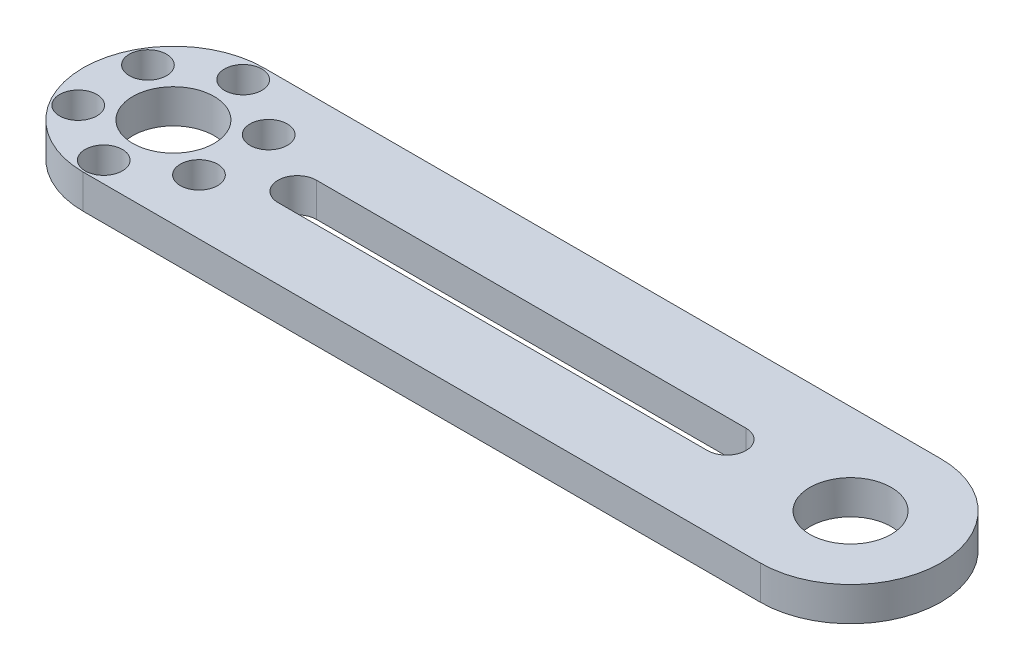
ISO-10303-21;
HEADER;
FILE_DESCRIPTION(('STEP AP214'),'2;1');
FILE_NAME('part.step','',(''),(''),'','','');
FILE_SCHEMA(('AUTOMOTIVE_DESIGN { 1 0 10303 214 1 1 1 1 }'));
ENDSEC;
DATA;
#1=APPLICATION_CONTEXT('core data for automotive mechanical design processes');
#2=APPLICATION_PROTOCOL_DEFINITION('international standard','automotive_design',2000,#1);
#3=PRODUCT_CONTEXT('',#1,'mechanical');
#4=PRODUCT('Part','Part','',(#3));
#5=PRODUCT_RELATED_PRODUCT_CATEGORY('part','',(#4));
#6=PRODUCT_DEFINITION_FORMATION('','',#4);
#7=PRODUCT_DEFINITION_CONTEXT('part definition',#1,'design');
#8=PRODUCT_DEFINITION('design','',#6,#7);
#9=PRODUCT_DEFINITION_SHAPE('','',#8);
#10=(LENGTH_UNIT() NAMED_UNIT(*) SI_UNIT(.MILLI.,.METRE.));
#11=(NAMED_UNIT(*) PLANE_ANGLE_UNIT() SI_UNIT($,.RADIAN.));
#12=(NAMED_UNIT(*) SI_UNIT($,.STERADIAN.) SOLID_ANGLE_UNIT());
#13=UNCERTAINTY_MEASURE_WITH_UNIT(LENGTH_MEASURE(1.E-05),#10,'distance_accuracy_value','');
#14=(GEOMETRIC_REPRESENTATION_CONTEXT(3) GLOBAL_UNCERTAINTY_ASSIGNED_CONTEXT((#13)) GLOBAL_UNIT_ASSIGNED_CONTEXT((#10,
#11,#12)) REPRESENTATION_CONTEXT('',''));
#15=CARTESIAN_POINT('',(0.,0.,0.));
#16=DIRECTION('',(0.,0.,1.));
#17=DIRECTION('',(1.,0.,0.));
#18=AXIS2_PLACEMENT_3D('',#15,#16,#17);
#19=CARTESIAN_POINT('',(51.,2.56,0.));
#20=DIRECTION('',(0.,1.,0.));
#21=DIRECTION('',(0.,0.,1.));
#22=AXIS2_PLACEMENT_3D('',#19,#20,#21);
#23=PLANE('',#22);
#24=CARTESIAN_POINT('',(-51.,2.56,-10.5));
#25=DIRECTION('',(0.,1.,0.));
#26=DIRECTION('',(0.,0.,1.));
#27=AXIS2_PLACEMENT_3D('',#24,#25,#26);
#28=CIRCLE('',#27,2.81);
#29=CARTESIAN_POINT('',(-51.,2.56,-7.68999999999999));
#30=VERTEX_POINT('',#29);
#31=EDGE_CURVE('E353',#30,#30,#28,.T.);
#32=ORIENTED_EDGE('',*,*,#31,.F.);
#33=EDGE_LOOP('',(#32));
#34=FACE_BOUND('',#33,.T.);
#35=CARTESIAN_POINT('',(-41.9067332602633,2.56,-5.2500000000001));
#36=DIRECTION('',(0.,1.,0.));
#37=DIRECTION('',(0.,0.,1.));
#38=AXIS2_PLACEMENT_3D('',#35,#36,#37);
#39=CIRCLE('',#38,2.81000000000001);
#40=CARTESIAN_POINT('',(-41.9067332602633,2.56,-2.44000000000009));
#41=VERTEX_POINT('',#40);
#42=EDGE_CURVE('E357',#41,#41,#39,.T.);
#43=ORIENTED_EDGE('',*,*,#42,.F.);
#44=EDGE_LOOP('',(#43));
#45=FACE_BOUND('',#44,.T.);
#46=CARTESIAN_POINT('',(-41.9067332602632,2.56,5.24999999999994));
#47=DIRECTION('',(0.,1.,0.));
#48=DIRECTION('',(0.,0.,1.));
#49=AXIS2_PLACEMENT_3D('',#46,#47,#48);
#50=CIRCLE('',#49,2.81000000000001);
#51=CARTESIAN_POINT('',(-41.9067332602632,2.56,8.05999999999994));
#52=VERTEX_POINT('',#51);
#53=EDGE_CURVE('E369',#52,#52,#50,.T.);
#54=ORIENTED_EDGE('',*,*,#53,.F.);
#55=EDGE_LOOP('',(#54));
#56=FACE_BOUND('',#55,.T.);
#57=CARTESIAN_POINT('',(-50.9999999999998,2.56,10.5));
#58=DIRECTION('',(0.,1.,0.));
#59=DIRECTION('',(0.,0.,1.));
#60=AXIS2_PLACEMENT_3D('',#57,#58,#59);
#61=CIRCLE('',#60,2.81);
#62=CARTESIAN_POINT('',(-50.9999999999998,2.56,13.31));
#63=VERTEX_POINT('',#62);
#64=EDGE_CURVE('E374',#63,#63,#61,.T.);
#65=ORIENTED_EDGE('',*,*,#64,.F.);
#66=EDGE_LOOP('',(#65));
#67=FACE_BOUND('',#66,.T.);
#68=CARTESIAN_POINT('',(-60.0932667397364,2.56,5.25000000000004));
#69=DIRECTION('',(0.,1.,0.));
#70=DIRECTION('',(0.,0.,1.));
#71=AXIS2_PLACEMENT_3D('',#68,#69,#70);
#72=CIRCLE('',#71,2.81);
#73=CARTESIAN_POINT('',(-60.0932667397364,2.56,8.06000000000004));
#74=VERTEX_POINT('',#73);
#75=EDGE_CURVE('E380',#74,#74,#72,.T.);
#76=ORIENTED_EDGE('',*,*,#75,.F.);
#77=EDGE_LOOP('',(#76));
#78=FACE_BOUND('',#77,.T.);
#79=CARTESIAN_POINT('',(-60.0932667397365,2.56,-5.24999999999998));
#80=DIRECTION('',(0.,1.,0.));
#81=DIRECTION('',(0.,0.,1.));
#82=AXIS2_PLACEMENT_3D('',#79,#80,#81);
#83=CIRCLE('',#82,2.81);
#84=CARTESIAN_POINT('',(-60.0932667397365,2.56,-2.43999999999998));
#85=VERTEX_POINT('',#84);
#86=EDGE_CURVE('E400',#85,#85,#83,.T.);
#87=ORIENTED_EDGE('',*,*,#86,.F.);
#88=EDGE_LOOP('',(#87));
#89=FACE_BOUND('',#88,.T.);
#90=CARTESIAN_POINT('',(51.,2.56,0.));
#91=DIRECTION('',(0.,1.,0.));
#92=DIRECTION('',(0.,0.,-1.));
#93=AXIS2_PLACEMENT_3D('',#90,#91,#92);
#94=CIRCLE('',#93,6.13);
#95=CARTESIAN_POINT('',(51.,2.56,-6.12999999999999));
#96=VERTEX_POINT('',#95);
#97=EDGE_CURVE('E365',#96,#96,#94,.T.);
#98=ORIENTED_EDGE('',*,*,#97,.F.);
#99=EDGE_LOOP('',(#98));
#100=FACE_BOUND('',#99,.T.);
#101=CARTESIAN_POINT('',(-51.,2.56,0.));
#102=DIRECTION('',(0.,1.,0.));
#103=DIRECTION('',(0.,0.,1.));
#104=AXIS2_PLACEMENT_3D('',#101,#102,#103);
#105=CIRCLE('',#104,6.13);
#106=CARTESIAN_POINT('',(-51.,2.56,6.13000000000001));
#107=VERTEX_POINT('',#106);
#108=EDGE_CURVE('E359',#107,#107,#105,.T.);
#109=ORIENTED_EDGE('',*,*,#108,.F.);
#110=EDGE_LOOP('',(#109));
#111=FACE_BOUND('',#110,.T.);
#112=CARTESIAN_POINT('',(51.,2.56,0.));
#113=DIRECTION('',(0.,1.,0.));
#114=DIRECTION('',(0.,0.,1.));
#115=AXIS2_PLACEMENT_3D('',#112,#113,#114);
#116=CIRCLE('',#115,13.6);
#117=CARTESIAN_POINT('',(51.,2.56,13.6));
#118=VERTEX_POINT('',#117);
#119=CARTESIAN_POINT('',(51.,2.56,-13.6));
#120=VERTEX_POINT('',#119);
#121=EDGE_CURVE('E165',#118,#120,#116,.T.);
#122=ORIENTED_EDGE('',*,*,#121,.T.);
#123=DIRECTION('',(-1.,0.,0.));
#124=VECTOR('',#123,1.);
#125=CARTESIAN_POINT('',(51.,2.56,-13.6));
#126=LINE('',#125,#124);
#127=CARTESIAN_POINT('',(-51.,2.56,-13.6));
#128=VERTEX_POINT('',#127);
#129=EDGE_CURVE('E168',#120,#128,#126,.T.);
#130=ORIENTED_EDGE('',*,*,#129,.T.);
#131=CARTESIAN_POINT('',(-51.,2.56,0.));
#132=DIRECTION('',(0.,1.,0.));
#133=DIRECTION('',(0.,0.,1.));
#134=AXIS2_PLACEMENT_3D('',#131,#132,#133);
#135=CIRCLE('',#134,13.6);
#136=CARTESIAN_POINT('',(-51.,2.56,13.6));
#137=VERTEX_POINT('',#136);
#138=EDGE_CURVE('E171',#128,#137,#135,.T.);
#139=ORIENTED_EDGE('',*,*,#138,.T.);
#140=DIRECTION('',(-1.,0.,0.));
#141=VECTOR('',#140,1.);
#142=CARTESIAN_POINT('',(51.,2.56,13.6));
#143=LINE('',#142,#141);
#144=EDGE_CURVE('E173',#118,#137,#143,.T.);
#145=ORIENTED_EDGE('',*,*,#144,.F.);
#146=EDGE_LOOP('',(#122,#130,#139,#145));
#147=FACE_BOUND('',#146,.T.);
#148=DIRECTION('',(-1.,0.,0.));
#149=VECTOR('',#148,1.);
#150=CARTESIAN_POINT('',(32.35,2.56,-2.91000000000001));
#151=LINE('',#150,#149);
#152=CARTESIAN_POINT('',(32.35,2.56,-2.91000000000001));
#153=VERTEX_POINT('',#152);
#154=CARTESIAN_POINT('',(-32.35,2.56,-2.90999999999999));
#155=VERTEX_POINT('',#154);
#156=EDGE_CURVE('E136',#153,#155,#151,.T.);
#157=ORIENTED_EDGE('',*,*,#156,.F.);
#158=CARTESIAN_POINT('',(32.35,2.56,0.));
#159=DIRECTION('',(0.,1.,0.));
#160=DIRECTION('',(0.,0.,1.));
#161=AXIS2_PLACEMENT_3D('',#158,#159,#160);
#162=CIRCLE('',#161,2.91);
#163=CARTESIAN_POINT('',(32.35,2.56,2.90999999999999));
#164=VERTEX_POINT('',#163);
#165=EDGE_CURVE('E128',#164,#153,#162,.T.);
#166=ORIENTED_EDGE('',*,*,#165,.F.);
#167=DIRECTION('',(-1.,0.,0.));
#168=VECTOR('',#167,1.);
#169=CARTESIAN_POINT('',(32.35,2.56,2.90999999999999));
#170=LINE('',#169,#168);
#171=CARTESIAN_POINT('',(-32.35,2.56,2.91000000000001));
#172=VERTEX_POINT('',#171);
#173=EDGE_CURVE('E150',#164,#172,#170,.T.);
#174=ORIENTED_EDGE('',*,*,#173,.T.);
#175=CARTESIAN_POINT('',(-32.35,2.56,0.));
#176=DIRECTION('',(0.,1.,0.));
#177=DIRECTION('',(0.,0.,1.));
#178=AXIS2_PLACEMENT_3D('',#175,#176,#177);
#179=CIRCLE('',#178,2.91);
#180=EDGE_CURVE('E148',#155,#172,#179,.T.);
#181=ORIENTED_EDGE('',*,*,#180,.F.);
#182=EDGE_LOOP('',(#157,#166,#174,#181));
#183=FACE_BOUND('',#182,.T.);
#184=ADVANCED_FACE('F63',(#34,#45,#56,#67,#78,#89,#100,#111,#147,#183),#23,.T.);
#185=CARTESIAN_POINT('',(51.,-2.56,0.));
#186=DIRECTION('',(0.,1.,0.));
#187=DIRECTION('',(0.,0.,1.));
#188=AXIS2_PLACEMENT_3D('',#185,#186,#187);
#189=PLANE('',#188);
#190=CARTESIAN_POINT('',(-51.,-2.56,-10.5));
#191=DIRECTION('',(0.,1.,0.));
#192=DIRECTION('',(0.,0.,1.));
#193=AXIS2_PLACEMENT_3D('',#190,#191,#192);
#194=CIRCLE('',#193,2.81);
#195=CARTESIAN_POINT('',(-51.,-2.56,-7.68999999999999));
#196=VERTEX_POINT('',#195);
#197=EDGE_CURVE('E356',#196,#196,#194,.F.);
#198=ORIENTED_EDGE('',*,*,#197,.F.);
#199=EDGE_LOOP('',(#198));
#200=FACE_BOUND('',#199,.T.);
#201=CARTESIAN_POINT('',(-41.9067332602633,-2.56,-5.2500000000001));
#202=DIRECTION('',(0.,1.,0.));
#203=DIRECTION('',(0.,0.,1.));
#204=AXIS2_PLACEMENT_3D('',#201,#202,#203);
#205=CIRCLE('',#204,2.81000000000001);
#206=CARTESIAN_POINT('',(-41.9067332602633,-2.56,-2.44000000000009));
#207=VERTEX_POINT('',#206);
#208=EDGE_CURVE('E362',#207,#207,#205,.F.);
#209=ORIENTED_EDGE('',*,*,#208,.F.);
#210=EDGE_LOOP('',(#209));
#211=FACE_BOUND('',#210,.T.);
#212=CARTESIAN_POINT('',(-41.9067332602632,-2.56,5.24999999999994));
#213=DIRECTION('',(0.,1.,0.));
#214=DIRECTION('',(0.,0.,1.));
#215=AXIS2_PLACEMENT_3D('',#212,#213,#214);
#216=CIRCLE('',#215,2.81000000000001);
#217=CARTESIAN_POINT('',(-41.9067332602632,-2.56,8.05999999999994));
#218=VERTEX_POINT('',#217);
#219=EDGE_CURVE('E371',#218,#218,#216,.F.);
#220=ORIENTED_EDGE('',*,*,#219,.F.);
#221=EDGE_LOOP('',(#220));
#222=FACE_BOUND('',#221,.T.);
#223=CARTESIAN_POINT('',(-50.9999999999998,-2.56,10.5));
#224=DIRECTION('',(0.,1.,0.));
#225=DIRECTION('',(0.,0.,1.));
#226=AXIS2_PLACEMENT_3D('',#223,#224,#225);
#227=CIRCLE('',#226,2.81);
#228=CARTESIAN_POINT('',(-50.9999999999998,-2.56,13.31));
#229=VERTEX_POINT('',#228);
#230=EDGE_CURVE('E377',#229,#229,#227,.F.);
#231=ORIENTED_EDGE('',*,*,#230,.F.);
#232=EDGE_LOOP('',(#231));
#233=FACE_BOUND('',#232,.T.);
#234=CARTESIAN_POINT('',(-60.0932667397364,-2.56,5.25000000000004));
#235=DIRECTION('',(0.,1.,0.));
#236=DIRECTION('',(0.,0.,1.));
#237=AXIS2_PLACEMENT_3D('',#234,#235,#236);
#238=CIRCLE('',#237,2.81);
#239=CARTESIAN_POINT('',(-60.0932667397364,-2.56,8.06000000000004));
#240=VERTEX_POINT('',#239);
#241=EDGE_CURVE('E411',#240,#240,#238,.F.);
#242=ORIENTED_EDGE('',*,*,#241,.F.);
#243=EDGE_LOOP('',(#242));
#244=FACE_BOUND('',#243,.T.);
#245=CARTESIAN_POINT('',(-60.0932667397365,-2.56,-5.24999999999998));
#246=DIRECTION('',(0.,1.,0.));
#247=DIRECTION('',(0.,0.,1.));
#248=AXIS2_PLACEMENT_3D('',#245,#246,#247);
#249=CIRCLE('',#248,2.81);
#250=CARTESIAN_POINT('',(-60.0932667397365,-2.56,-2.43999999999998));
#251=VERTEX_POINT('',#250);
#252=EDGE_CURVE('E403',#251,#251,#249,.F.);
#253=ORIENTED_EDGE('',*,*,#252,.F.);
#254=EDGE_LOOP('',(#253));
#255=FACE_BOUND('',#254,.T.);
#256=CARTESIAN_POINT('',(51.,-2.56,0.));
#257=DIRECTION('',(0.,1.,0.));
#258=DIRECTION('',(0.,0.,1.));
#259=AXIS2_PLACEMENT_3D('',#256,#257,#258);
#260=CIRCLE('',#259,6.13);
#261=CARTESIAN_POINT('',(51.,-2.56,6.13000000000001));
#262=VERTEX_POINT('',#261);
#263=EDGE_CURVE('E404',#262,#262,#260,.F.);
#264=ORIENTED_EDGE('',*,*,#263,.F.);
#265=EDGE_LOOP('',(#264));
#266=FACE_BOUND('',#265,.T.);
#267=CARTESIAN_POINT('',(-51.,-2.56,0.));
#268=DIRECTION('',(0.,1.,0.));
#269=DIRECTION('',(0.,0.,1.));
#270=AXIS2_PLACEMENT_3D('',#267,#268,#269);
#271=CIRCLE('',#270,6.13);
#272=CARTESIAN_POINT('',(-51.,-2.56,6.13000000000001));
#273=VERTEX_POINT('',#272);
#274=EDGE_CURVE('E156',#273,#273,#271,.F.);
#275=ORIENTED_EDGE('',*,*,#274,.F.);
#276=EDGE_LOOP('',(#275));
#277=FACE_BOUND('',#276,.T.);
#278=CARTESIAN_POINT('',(51.,-2.56,0.));
#279=DIRECTION('',(0.,1.,0.));
#280=DIRECTION('',(0.,0.,1.));
#281=AXIS2_PLACEMENT_3D('',#278,#279,#280);
#282=CIRCLE('',#281,13.6);
#283=CARTESIAN_POINT('',(51.,-2.56,13.6));
#284=VERTEX_POINT('',#283);
#285=CARTESIAN_POINT('',(51.,-2.56,-13.6));
#286=VERTEX_POINT('',#285);
#287=EDGE_CURVE('E144',#284,#286,#282,.T.);
#288=ORIENTED_EDGE('',*,*,#287,.F.);
#289=DIRECTION('',(-1.,0.,0.));
#290=VECTOR('',#289,1.);
#291=CARTESIAN_POINT('',(51.,-2.56,13.6));
#292=LINE('',#291,#290);
#293=CARTESIAN_POINT('',(-51.,-2.56,13.6));
#294=VERTEX_POINT('',#293);
#295=EDGE_CURVE('E169',#284,#294,#292,.T.);
#296=ORIENTED_EDGE('',*,*,#295,.T.);
#297=CARTESIAN_POINT('',(-51.,-2.56,0.));
#298=DIRECTION('',(0.,1.,0.));
#299=DIRECTION('',(0.,0.,1.));
#300=AXIS2_PLACEMENT_3D('',#297,#298,#299);
#301=CIRCLE('',#300,13.6);
#302=CARTESIAN_POINT('',(-51.,-2.56,-13.6));
#303=VERTEX_POINT('',#302);
#304=EDGE_CURVE('E181',#303,#294,#301,.T.);
#305=ORIENTED_EDGE('',*,*,#304,.F.);
#306=DIRECTION('',(-1.,0.,0.));
#307=VECTOR('',#306,1.);
#308=CARTESIAN_POINT('',(51.,-2.56,-13.6));
#309=LINE('',#308,#307);
#310=EDGE_CURVE('E179',#286,#303,#309,.T.);
#311=ORIENTED_EDGE('',*,*,#310,.F.);
#312=EDGE_LOOP('',(#288,#296,#305,#311));
#313=FACE_BOUND('',#312,.T.);
#314=CARTESIAN_POINT('',(32.35,-2.56,0.));
#315=DIRECTION('',(0.,1.,0.));
#316=DIRECTION('',(0.,0.,1.));
#317=AXIS2_PLACEMENT_3D('',#314,#315,#316);
#318=CIRCLE('',#317,2.91);
#319=CARTESIAN_POINT('',(32.35,-2.56,2.90999999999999));
#320=VERTEX_POINT('',#319);
#321=CARTESIAN_POINT('',(32.35,-2.56,-2.91000000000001));
#322=VERTEX_POINT('',#321);
#323=EDGE_CURVE('E86',#320,#322,#318,.T.);
#324=ORIENTED_EDGE('',*,*,#323,.T.);
#325=DIRECTION('',(-1.,0.,0.));
#326=VECTOR('',#325,1.);
#327=CARTESIAN_POINT('',(32.35,-2.56,-2.91000000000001));
#328=LINE('',#327,#326);
#329=CARTESIAN_POINT('',(-32.35,-2.56,-2.90999999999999));
#330=VERTEX_POINT('',#329);
#331=EDGE_CURVE('E143',#322,#330,#328,.T.);
#332=ORIENTED_EDGE('',*,*,#331,.T.);
#333=CARTESIAN_POINT('',(-32.35,-2.56,0.));
#334=DIRECTION('',(0.,1.,0.));
#335=DIRECTION('',(0.,0.,1.));
#336=AXIS2_PLACEMENT_3D('',#333,#334,#335);
#337=CIRCLE('',#336,2.91);
#338=CARTESIAN_POINT('',(-32.35,-2.56,2.91000000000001));
#339=VERTEX_POINT('',#338);
#340=EDGE_CURVE('E158',#330,#339,#337,.T.);
#341=ORIENTED_EDGE('',*,*,#340,.T.);
#342=DIRECTION('',(-1.,0.,0.));
#343=VECTOR('',#342,1.);
#344=CARTESIAN_POINT('',(32.35,-2.56,2.90999999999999));
#345=LINE('',#344,#343);
#346=EDGE_CURVE('E137',#320,#339,#345,.T.);
#347=ORIENTED_EDGE('',*,*,#346,.F.);
#348=EDGE_LOOP('',(#324,#332,#341,#347));
#349=FACE_BOUND('',#348,.T.);
#350=ADVANCED_FACE('F198',(#200,#211,#222,#233,#244,#255,#266,#277,#313,#349),#189,.F.);
#351=CARTESIAN_POINT('',(51.,2.56,0.));
#352=DIRECTION('',(0.,-1.,0.));
#353=DIRECTION('',(0.,0.,-1.));
#354=AXIS2_PLACEMENT_3D('',#351,#352,#353);
#355=CYLINDRICAL_SURFACE('',#354,13.6);
#356=ORIENTED_EDGE('',*,*,#287,.T.);
#357=DIRECTION('',(0.,-1.,0.));
#358=VECTOR('',#357,1.);
#359=CARTESIAN_POINT('',(51.,2.56,-13.6));
#360=LINE('',#359,#358);
#361=EDGE_CURVE('E12',#120,#286,#360,.T.);
#362=ORIENTED_EDGE('',*,*,#361,.F.);
#363=ORIENTED_EDGE('',*,*,#121,.F.);
#364=DIRECTION('',(0.,-1.,0.));
#365=VECTOR('',#364,1.);
#366=CARTESIAN_POINT('',(51.,2.56,13.6));
#367=LINE('',#366,#365);
#368=EDGE_CURVE('E176',#118,#284,#367,.T.);
#369=ORIENTED_EDGE('',*,*,#368,.T.);
#370=EDGE_LOOP('',(#356,#362,#363,#369));
#371=FACE_BOUND('',#370,.T.);
#372=ADVANCED_FACE('F65',(#371),#355,.T.);
#373=CARTESIAN_POINT('',(51.,2.56,-13.6));
#374=DIRECTION('',(0.,0.,1.));
#375=DIRECTION('',(1.,0.,0.));
#376=AXIS2_PLACEMENT_3D('',#373,#374,#375);
#377=PLANE('',#376);
#378=ORIENTED_EDGE('',*,*,#310,.T.);
#379=DIRECTION('',(0.,-1.,0.));
#380=VECTOR('',#379,1.);
#381=CARTESIAN_POINT('',(-51.,2.56,-13.6));
#382=LINE('',#381,#380);
#383=EDGE_CURVE('E71',#128,#303,#382,.T.);
#384=ORIENTED_EDGE('',*,*,#383,.F.);
#385=ORIENTED_EDGE('',*,*,#129,.F.);
#386=ORIENTED_EDGE('',*,*,#361,.T.);
#387=EDGE_LOOP('',(#378,#384,#385,#386));
#388=FACE_BOUND('',#387,.T.);
#389=ADVANCED_FACE('F207',(#388),#377,.F.);
#390=CARTESIAN_POINT('',(-51.,2.56,0.));
#391=DIRECTION('',(0.,-1.,0.));
#392=DIRECTION('',(0.,0.,-1.));
#393=AXIS2_PLACEMENT_3D('',#390,#391,#392);
#394=CYLINDRICAL_SURFACE('',#393,13.6);
#395=ORIENTED_EDGE('',*,*,#304,.T.);
#396=DIRECTION('',(0.,-1.,0.));
#397=VECTOR('',#396,1.);
#398=CARTESIAN_POINT('',(-51.,2.56,13.6));
#399=LINE('',#398,#397);
#400=EDGE_CURVE('E187',#137,#294,#399,.T.);
#401=ORIENTED_EDGE('',*,*,#400,.F.);
#402=ORIENTED_EDGE('',*,*,#138,.F.);
#403=ORIENTED_EDGE('',*,*,#383,.T.);
#404=EDGE_LOOP('',(#395,#401,#402,#403));
#405=FACE_BOUND('',#404,.T.);
#406=ADVANCED_FACE('F193',(#405),#394,.T.);
#407=CARTESIAN_POINT('',(51.,2.56,13.6));
#408=DIRECTION('',(0.,0.,1.));
#409=DIRECTION('',(1.,0.,0.));
#410=AXIS2_PLACEMENT_3D('',#407,#408,#409);
#411=PLANE('',#410);
#412=ORIENTED_EDGE('',*,*,#295,.F.);
#413=ORIENTED_EDGE('',*,*,#368,.F.);
#414=ORIENTED_EDGE('',*,*,#144,.T.);
#415=ORIENTED_EDGE('',*,*,#400,.T.);
#416=EDGE_LOOP('',(#412,#413,#414,#415));
#417=FACE_BOUND('',#416,.T.);
#418=ADVANCED_FACE('F202',(#417),#411,.T.);
#419=CARTESIAN_POINT('',(32.35,2.56,0.));
#420=DIRECTION('',(0.,-1.,0.));
#421=DIRECTION('',(0.,0.,-1.));
#422=AXIS2_PLACEMENT_3D('',#419,#420,#421);
#423=CYLINDRICAL_SURFACE('',#422,2.91);
#424=ORIENTED_EDGE('',*,*,#323,.F.);
#425=DIRECTION('',(0.,-1.,0.));
#426=VECTOR('',#425,1.);
#427=CARTESIAN_POINT('',(32.35,2.56,2.90999999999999));
#428=LINE('',#427,#426);
#429=EDGE_CURVE('E132',#164,#320,#428,.T.);
#430=ORIENTED_EDGE('',*,*,#429,.F.);
#431=ORIENTED_EDGE('',*,*,#165,.T.);
#432=DIRECTION('',(0.,-1.,0.));
#433=VECTOR('',#432,1.);
#434=CARTESIAN_POINT('',(32.35,2.56,-2.91000000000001));
#435=LINE('',#434,#433);
#436=EDGE_CURVE('E131',#153,#322,#435,.T.);
#437=ORIENTED_EDGE('',*,*,#436,.T.);
#438=EDGE_LOOP('',(#424,#430,#431,#437));
#439=FACE_BOUND('',#438,.T.);
#440=ADVANCED_FACE('F130',(#439),#423,.F.);
#441=CARTESIAN_POINT('',(32.35,2.56,-2.91000000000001));
#442=DIRECTION('',(0.,0.,1.));
#443=DIRECTION('',(1.,0.,0.));
#444=AXIS2_PLACEMENT_3D('',#441,#442,#443);
#445=PLANE('',#444);
#446=ORIENTED_EDGE('',*,*,#331,.F.);
#447=ORIENTED_EDGE('',*,*,#436,.F.);
#448=ORIENTED_EDGE('',*,*,#156,.T.);
#449=DIRECTION('',(0.,-1.,0.));
#450=VECTOR('',#449,1.);
#451=CARTESIAN_POINT('',(-32.35,2.56,-2.90999999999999));
#452=LINE('',#451,#450);
#453=EDGE_CURVE('E145',#155,#330,#452,.T.);
#454=ORIENTED_EDGE('',*,*,#453,.T.);
#455=EDGE_LOOP('',(#446,#447,#448,#454));
#456=FACE_BOUND('',#455,.T.);
#457=ADVANCED_FACE('F140',(#456),#445,.T.);
#458=CARTESIAN_POINT('',(-32.35,2.56,0.));
#459=DIRECTION('',(0.,-1.,0.));
#460=DIRECTION('',(0.,0.,-1.));
#461=AXIS2_PLACEMENT_3D('',#458,#459,#460);
#462=CYLINDRICAL_SURFACE('',#461,2.91);
#463=ORIENTED_EDGE('',*,*,#340,.F.);
#464=ORIENTED_EDGE('',*,*,#453,.F.);
#465=ORIENTED_EDGE('',*,*,#180,.T.);
#466=DIRECTION('',(0.,-1.,0.));
#467=VECTOR('',#466,1.);
#468=CARTESIAN_POINT('',(-32.35,2.56,2.91000000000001));
#469=LINE('',#468,#467);
#470=EDGE_CURVE('E78',#172,#339,#469,.T.);
#471=ORIENTED_EDGE('',*,*,#470,.T.);
#472=EDGE_LOOP('',(#463,#464,#465,#471));
#473=FACE_BOUND('',#472,.T.);
#474=ADVANCED_FACE('F252',(#473),#462,.F.);
#475=CARTESIAN_POINT('',(32.35,2.56,2.90999999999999));
#476=DIRECTION('',(0.,0.,1.));
#477=DIRECTION('',(1.,0.,0.));
#478=AXIS2_PLACEMENT_3D('',#475,#476,#477);
#479=PLANE('',#478);
#480=ORIENTED_EDGE('',*,*,#346,.T.);
#481=ORIENTED_EDGE('',*,*,#470,.F.);
#482=ORIENTED_EDGE('',*,*,#173,.F.);
#483=ORIENTED_EDGE('',*,*,#429,.T.);
#484=EDGE_LOOP('',(#480,#481,#482,#483));
#485=FACE_BOUND('',#484,.T.);
#486=ADVANCED_FACE('F258',(#485),#479,.F.);
#487=CARTESIAN_POINT('',(-51.,-2.561,0.));
#488=DIRECTION('',(0.,1.,0.));
#489=DIRECTION('',(0.,0.,1.));
#490=AXIS2_PLACEMENT_3D('',#487,#488,#489);
#491=CYLINDRICAL_SURFACE('',#490,6.13);
#492=ORIENTED_EDGE('',*,*,#108,.T.);
#493=EDGE_LOOP('',(#492));
#494=FACE_BOUND('',#493,.T.);
#495=ORIENTED_EDGE('',*,*,#274,.T.);
#496=EDGE_LOOP('',(#495));
#497=FACE_BOUND('',#496,.T.);
#498=ADVANCED_FACE('F266',(#494,#497),#491,.F.);
#499=CARTESIAN_POINT('',(51.,-2.561,0.));
#500=DIRECTION('',(0.,1.,0.));
#501=DIRECTION('',(0.,0.,1.));
#502=AXIS2_PLACEMENT_3D('',#499,#500,#501);
#503=CYLINDRICAL_SURFACE('',#502,6.13);
#504=ORIENTED_EDGE('',*,*,#97,.T.);
#505=EDGE_LOOP('',(#504));
#506=FACE_BOUND('',#505,.T.);
#507=ORIENTED_EDGE('',*,*,#263,.T.);
#508=EDGE_LOOP('',(#507));
#509=FACE_BOUND('',#508,.T.);
#510=ADVANCED_FACE('F278',(#506,#509),#503,.F.);
#511=CARTESIAN_POINT('',(-60.0932667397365,-2.561,-5.24999999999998));
#512=DIRECTION('',(0.,1.,0.));
#513=DIRECTION('',(0.,0.,1.));
#514=AXIS2_PLACEMENT_3D('',#511,#512,#513);
#515=CYLINDRICAL_SURFACE('',#514,2.81);
#516=ORIENTED_EDGE('',*,*,#86,.T.);
#517=EDGE_LOOP('',(#516));
#518=FACE_BOUND('',#517,.T.);
#519=ORIENTED_EDGE('',*,*,#252,.T.);
#520=EDGE_LOOP('',(#519));
#521=FACE_BOUND('',#520,.T.);
#522=ADVANCED_FACE('F288',(#518,#521),#515,.F.);
#523=CARTESIAN_POINT('',(-60.0932667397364,-2.561,5.25000000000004));
#524=DIRECTION('',(0.,1.,0.));
#525=DIRECTION('',(0.,0.,1.));
#526=AXIS2_PLACEMENT_3D('',#523,#524,#525);
#527=CYLINDRICAL_SURFACE('',#526,2.81);
#528=ORIENTED_EDGE('',*,*,#75,.T.);
#529=EDGE_LOOP('',(#528));
#530=FACE_BOUND('',#529,.T.);
#531=ORIENTED_EDGE('',*,*,#241,.T.);
#532=EDGE_LOOP('',(#531));
#533=FACE_BOUND('',#532,.T.);
#534=ADVANCED_FACE('F298',(#530,#533),#527,.F.);
#535=CARTESIAN_POINT('',(-50.9999999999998,-2.561,10.5));
#536=DIRECTION('',(0.,1.,0.));
#537=DIRECTION('',(0.,0.,1.));
#538=AXIS2_PLACEMENT_3D('',#535,#536,#537);
#539=CYLINDRICAL_SURFACE('',#538,2.81);
#540=ORIENTED_EDGE('',*,*,#64,.T.);
#541=EDGE_LOOP('',(#540));
#542=FACE_BOUND('',#541,.T.);
#543=ORIENTED_EDGE('',*,*,#230,.T.);
#544=EDGE_LOOP('',(#543));
#545=FACE_BOUND('',#544,.T.);
#546=ADVANCED_FACE('F308',(#542,#545),#539,.F.);
#547=CARTESIAN_POINT('',(-41.9067332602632,-2.561,5.24999999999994));
#548=DIRECTION('',(0.,1.,0.));
#549=DIRECTION('',(0.,0.,1.));
#550=AXIS2_PLACEMENT_3D('',#547,#548,#549);
#551=CYLINDRICAL_SURFACE('',#550,2.81000000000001);
#552=ORIENTED_EDGE('',*,*,#53,.T.);
#553=EDGE_LOOP('',(#552));
#554=FACE_BOUND('',#553,.T.);
#555=ORIENTED_EDGE('',*,*,#219,.T.);
#556=EDGE_LOOP('',(#555));
#557=FACE_BOUND('',#556,.T.);
#558=ADVANCED_FACE('F318',(#554,#557),#551,.F.);
#559=CARTESIAN_POINT('',(-41.9067332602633,-2.561,-5.2500000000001));
#560=DIRECTION('',(0.,1.,0.));
#561=DIRECTION('',(0.,0.,1.));
#562=AXIS2_PLACEMENT_3D('',#559,#560,#561);
#563=CYLINDRICAL_SURFACE('',#562,2.81000000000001);
#564=ORIENTED_EDGE('',*,*,#42,.T.);
#565=EDGE_LOOP('',(#564));
#566=FACE_BOUND('',#565,.T.);
#567=ORIENTED_EDGE('',*,*,#208,.T.);
#568=EDGE_LOOP('',(#567));
#569=FACE_BOUND('',#568,.T.);
#570=ADVANCED_FACE('F328',(#566,#569),#563,.F.);
#571=CARTESIAN_POINT('',(-51.,-2.561,-10.5));
#572=DIRECTION('',(0.,1.,0.));
#573=DIRECTION('',(0.,0.,1.));
#574=AXIS2_PLACEMENT_3D('',#571,#572,#573);
#575=CYLINDRICAL_SURFACE('',#574,2.81);
#576=ORIENTED_EDGE('',*,*,#31,.T.);
#577=EDGE_LOOP('',(#576));
#578=FACE_BOUND('',#577,.T.);
#579=ORIENTED_EDGE('',*,*,#197,.T.);
#580=EDGE_LOOP('',(#579));
#581=FACE_BOUND('',#580,.T.);
#582=ADVANCED_FACE('F338',(#578,#581),#575,.F.);
#583=CLOSED_SHELL('',(#184,#350,#372,#389,#406,#418,#440,#457,#474,#486,#498,#510,#522,#534,
#546,#558,#570,#582));
#584=MANIFOLD_SOLID_BREP('B2',#583);
#585=ADVANCED_BREP_SHAPE_REPRESENTATION('',(#18,#584),#14);
#586=SHAPE_DEFINITION_REPRESENTATION(#9,#585);
ENDSEC;
END-ISO-10303-21;
